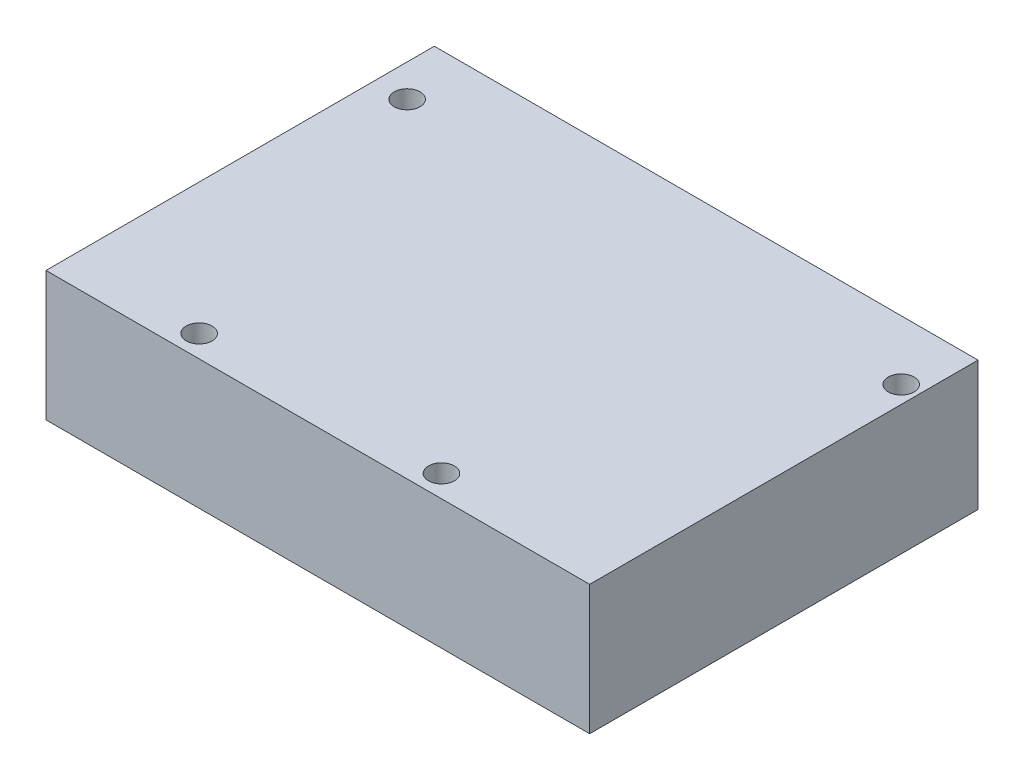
from build123d import *

# Parameters (mm, degrees)
SKETCH_1_W          = 21
SKETCH_1_H          = 15
EXTRUDE_1_DEPTH     = 5
SKETCH_2_R          = 0.5
CUT_EXTRUDE_1_DEPTH = 5


with BuildPart() as part:
    # Sketch 1 → Extrude 1 (new body)
    with BuildSketch(Plane(origin=(0, 0, 0), x_dir=(1, 0, 0), z_dir=(0, 1, 0))):
        with Locations((2, 0)):
            Rectangle(SKETCH_1_W, SKETCH_1_H)
    extrude(amount=-EXTRUDE_1_DEPTH)

    # Sketch 2 → Cut-Extrude 1 (cut)
    with BuildSketch(Plane(origin=(0, 0, 0), x_dir=(1, 0, 0), z_dir=(0, 1, 0))):
        with Locations(Location((-7.25, 5.2, 0), (0, 0, 270))):
            Circle(SKETCH_2_R)
        with Locations(Location((11.831305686, 5.2, 0), (0, 0, 270))):
            Circle(SKETCH_2_R)
        with Locations(Location((5.92624029, -6.651051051, 0), (0, 0, 270))):
            Circle(SKETCH_2_R)
        with Locations(Location((-3.433916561, -6.651051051, 0), (0, 0, 270))):
            Circle(SKETCH_2_R)
    extrude(amount=-CUT_EXTRUDE_1_DEPTH, mode=Mode.SUBTRACT)


solid = part.part
